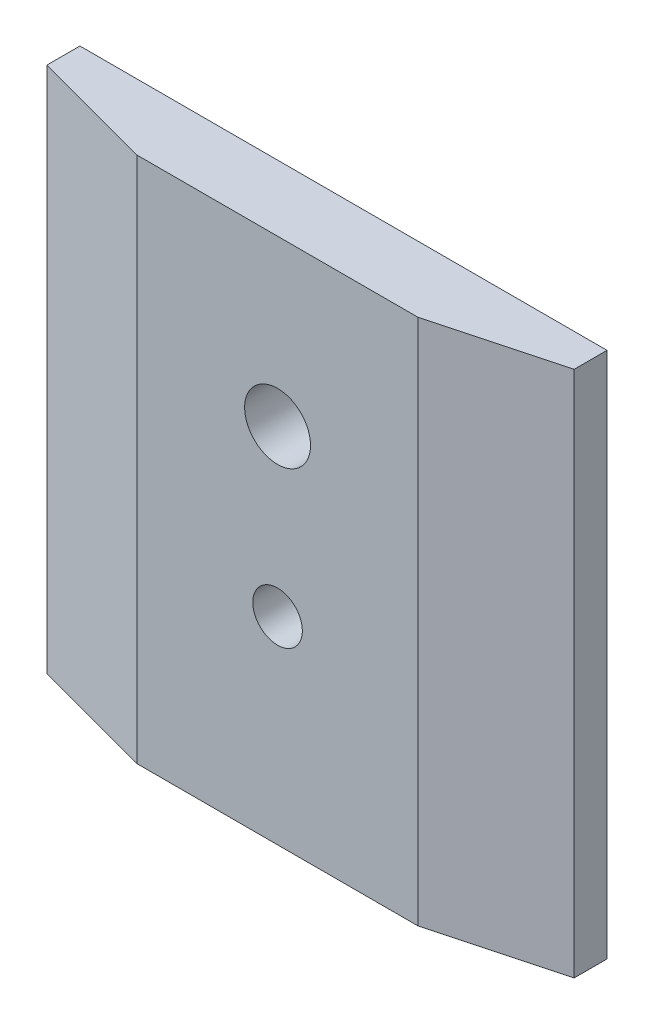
from build123d import *

# Parameters (mm, degrees)
SKETCH2_W           = 50.8
SKETCH2_H           = 50.8
SKETCH2_R           = 2.3876
SKETCH2_R_2         = 3.175
BOSS_EXTRUDE1_DEPTH = 6.35
CHAMFER1_SIZE       = 3.175
CHAMFER1_SIZE2      = 11.849261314
CHAMFER2_SIZE       = 3.175
CHAMFER2_SIZE2      = 11.849261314


with BuildPart() as part:
    # Sketch2 → Boss-Extrude1 (new body)
    with BuildSketch(Plane.XY):
        Rectangle(SKETCH2_W, SKETCH2_H)
        with Locations((0, -6.35)):
            Circle(SKETCH2_R, mode=Mode.SUBTRACT)
        with Locations((0, 9.525)):
            Circle(SKETCH2_R_2, mode=Mode.SUBTRACT)
    extrude(amount=BOSS_EXTRUDE1_DEPTH)

    # Chamfer1
    chamfer1_edges = [part.edges().sort_by_distance(p)[0] for p in [
        (25.4, 0, 6.35),
    ]]
    chamfer1_side = [part.faces().sort_by_distance(p)[0] for p in [
        (25.4, 0, 3.175),
    ]]
    chamfer(chamfer1_edges, length=CHAMFER1_SIZE, length2=CHAMFER1_SIZE2, reference=chamfer1_side[0])

    # Chamfer2
    chamfer2_edges = [part.edges().sort_by_distance(p)[0] for p in [
        (-25.4, 0, 6.35),
    ]]
    chamfer2_side = [part.faces().sort_by_distance(p)[0] for p in [
        (-25.4, 0, 3.175),
    ]]
    chamfer(chamfer2_edges, length=CHAMFER2_SIZE, length2=CHAMFER2_SIZE2, reference=chamfer2_side[0])


solid = part.part
